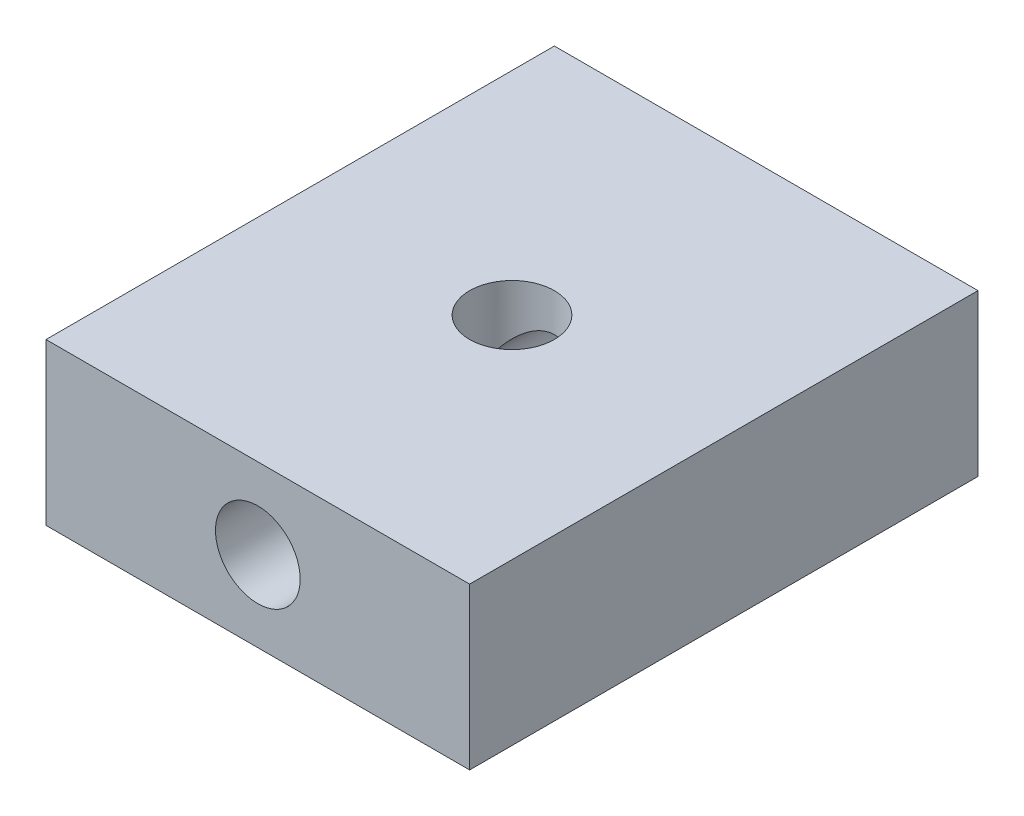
from build123d import *

# Parameters (mm, degrees)
SKETCH1_W           = 50
SKETCH1_H           = 60
BOSS_EXTRUDE1_DEPTH = 19
SKETCH2_R           = 5
CUT_EXTRUDE1_DEPTH  = 68.720011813
SKETCH3_R           = 5
CUT_EXTRUDE2_DEPTH  = 9


with BuildPart() as part:
    # Sketch1 → Boss-Extrude1 (new body)
    with BuildSketch(Plane(origin=(0, 0, 0), x_dir=(1, 0, 0), z_dir=(0, 1, 0))):
        Rectangle(SKETCH1_W, SKETCH1_H)
    extrude(amount=BOSS_EXTRUDE1_DEPTH)

    # Sketch2 → Cut-Extrude1 (cut, through all)
    with BuildSketch(Plane.XY.offset(30)):
        with Locations((0, 9.5)):
            Circle(SKETCH2_R)
    extrude(amount=-CUT_EXTRUDE1_DEPTH, mode=Mode.SUBTRACT)

    # Sketch3 → Cut-Extrude2 (cut)
    with BuildSketch(Plane(origin=(0, 19, 0), x_dir=(1, 0, 0), z_dir=(0, 1, 0))):
        with Locations(Location((0, 0, 0), (0, 0, 270))):
            Circle(SKETCH3_R)
    extrude(amount=-CUT_EXTRUDE2_DEPTH, mode=Mode.SUBTRACT)


solid = part.part
